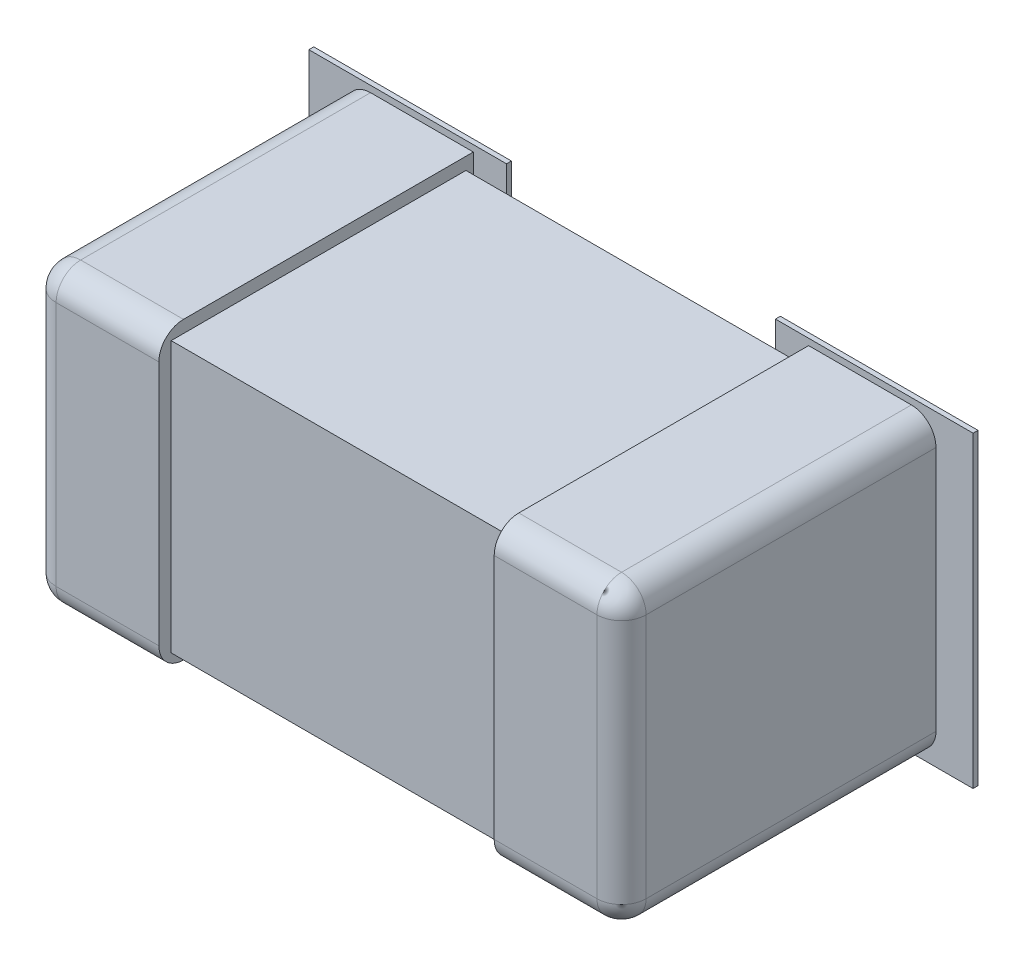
ISO-10303-21;
HEADER;
FILE_DESCRIPTION(('STEP AP214'),'2;1');
FILE_NAME('part.step','',(''),(''),'','','');
FILE_SCHEMA(('AUTOMOTIVE_DESIGN { 1 0 10303 214 1 1 1 1 }'));
ENDSEC;
DATA;
#1=APPLICATION_CONTEXT('core data for automotive mechanical design processes');
#2=APPLICATION_PROTOCOL_DEFINITION('international standard','automotive_design',2000,#1);
#3=PRODUCT_CONTEXT('',#1,'mechanical');
#4=PRODUCT('Part','Part','',(#3));
#5=PRODUCT_RELATED_PRODUCT_CATEGORY('part','',(#4));
#6=PRODUCT_DEFINITION_FORMATION('','',#4);
#7=PRODUCT_DEFINITION_CONTEXT('part definition',#1,'design');
#8=PRODUCT_DEFINITION('design','',#6,#7);
#9=PRODUCT_DEFINITION_SHAPE('','',#8);
#10=(LENGTH_UNIT() NAMED_UNIT(*) SI_UNIT(.MILLI.,.METRE.));
#11=(NAMED_UNIT(*) PLANE_ANGLE_UNIT() SI_UNIT($,.RADIAN.));
#12=(NAMED_UNIT(*) SI_UNIT($,.STERADIAN.) SOLID_ANGLE_UNIT());
#13=UNCERTAINTY_MEASURE_WITH_UNIT(LENGTH_MEASURE(1.E-05),#10,'distance_accuracy_value','');
#14=(GEOMETRIC_REPRESENTATION_CONTEXT(3) GLOBAL_UNCERTAINTY_ASSIGNED_CONTEXT((#13)) GLOBAL_UNIT_ASSIGNED_CONTEXT((#10,
#11,#12)) REPRESENTATION_CONTEXT('',''));
#15=CARTESIAN_POINT('',(0.,0.,0.));
#16=DIRECTION('',(0.,0.,1.));
#17=DIRECTION('',(1.,0.,0.));
#18=AXIS2_PLACEMENT_3D('',#15,#16,#17);
#19=CARTESIAN_POINT('',(0.,0.,0.0762));
#20=DIRECTION('',(0.,0.,1.));
#21=DIRECTION('',(1.,0.,0.));
#22=AXIS2_PLACEMENT_3D('',#19,#20,#21);
#23=PLANE('',#22);
#24=DIRECTION('',(1.,0.,0.));
#25=VECTOR('',#24,1.);
#26=CARTESIAN_POINT('',(0.138938,-0.159004,0.0762));
#27=LINE('',#26,#25);
#28=CARTESIAN_POINT('',(0.138938,-0.159004,0.0762));
#29=VERTEX_POINT('',#28);
#30=CARTESIAN_POINT('',(0.343154,-0.159004,0.0762));
#31=VERTEX_POINT('',#30);
#32=EDGE_CURVE('E330',#29,#31,#27,.T.);
#33=ORIENTED_EDGE('',*,*,#32,.F.);
#34=DIRECTION('',(0.,1.,0.));
#35=VECTOR('',#34,1.);
#36=CARTESIAN_POINT('',(0.138938,0.159004,0.0762));
#37=LINE('',#36,#35);
#38=CARTESIAN_POINT('',(0.138938,0.159004,0.0762));
#39=VERTEX_POINT('',#38);
#40=EDGE_CURVE('E335',#39,#29,#37,.F.);
#41=ORIENTED_EDGE('',*,*,#40,.F.);
#42=DIRECTION('',(1.,0.,0.));
#43=VECTOR('',#42,1.);
#44=CARTESIAN_POINT('',(0.343154,0.159004,0.0762));
#45=LINE('',#44,#43);
#46=CARTESIAN_POINT('',(0.343154,0.159004,0.0762));
#47=VERTEX_POINT('',#46);
#48=EDGE_CURVE('E319',#47,#39,#45,.F.);
#49=ORIENTED_EDGE('',*,*,#48,.F.);
#50=DIRECTION('',(0.,1.,0.));
#51=VECTOR('',#50,1.);
#52=CARTESIAN_POINT('',(0.343154,-0.159004,0.0762));
#53=LINE('',#52,#51);
#54=EDGE_CURVE('E95',#31,#47,#53,.T.);
#55=ORIENTED_EDGE('',*,*,#54,.F.);
#56=EDGE_LOOP('',(#33,#41,#49,#55));
#57=FACE_BOUND('',#56,.T.);
#58=ADVANCED_FACE('F16',(#57),#23,.F.);
#59=CARTESIAN_POINT('',(0.,0.,0.0762));
#60=DIRECTION('',(0.,0.,1.));
#61=DIRECTION('',(1.,0.,0.));
#62=AXIS2_PLACEMENT_3D('',#59,#60,#61);
#63=PLANE('',#62);
#64=DIRECTION('',(1.,0.,0.));
#65=VECTOR('',#64,1.);
#66=CARTESIAN_POINT('',(-0.138938,0.159004,0.0762));
#67=LINE('',#66,#65);
#68=CARTESIAN_POINT('',(-0.138938,0.159004,0.0762));
#69=VERTEX_POINT('',#68);
#70=CARTESIAN_POINT('',(-0.343154,0.159004,0.0762));
#71=VERTEX_POINT('',#70);
#72=EDGE_CURVE('E278',#69,#71,#67,.F.);
#73=ORIENTED_EDGE('',*,*,#72,.F.);
#74=DIRECTION('',(0.,1.,0.));
#75=VECTOR('',#74,1.);
#76=CARTESIAN_POINT('',(-0.138938,-0.159004,0.0762));
#77=LINE('',#76,#75);
#78=CARTESIAN_POINT('',(-0.138938,-0.159004,0.0762));
#79=VERTEX_POINT('',#78);
#80=EDGE_CURVE('E284',#79,#69,#77,.T.);
#81=ORIENTED_EDGE('',*,*,#80,.F.);
#82=DIRECTION('',(1.,0.,0.));
#83=VECTOR('',#82,1.);
#84=CARTESIAN_POINT('',(-0.343154,-0.159004,0.0762));
#85=LINE('',#84,#83);
#86=CARTESIAN_POINT('',(-0.343154,-0.159004,0.0762));
#87=VERTEX_POINT('',#86);
#88=EDGE_CURVE('E263',#87,#79,#85,.T.);
#89=ORIENTED_EDGE('',*,*,#88,.F.);
#90=DIRECTION('',(0.,1.,0.));
#91=VECTOR('',#90,1.);
#92=CARTESIAN_POINT('',(-0.343154,0.159004,0.0762));
#93=LINE('',#92,#91);
#94=EDGE_CURVE('E272',#71,#87,#93,.F.);
#95=ORIENTED_EDGE('',*,*,#94,.F.);
#96=EDGE_LOOP('',(#73,#81,#89,#95));
#97=FACE_BOUND('',#96,.T.);
#98=ADVANCED_FACE('F663',(#97),#63,.F.);
#99=CARTESIAN_POINT('',(0.138938,0.159004,0.0762));
#100=DIRECTION('',(-1.,0.,0.));
#101=DIRECTION('',(0.,0.,1.));
#102=AXIS2_PLACEMENT_3D('',#99,#100,#101);
#103=PLANE('',#102);
#104=DIRECTION('',(0.,0.,1.));
#105=VECTOR('',#104,1.);
#106=CARTESIAN_POINT('',(0.138938,0.159004,0.0762));
#107=LINE('',#106,#105);
#108=CARTESIAN_POINT('',(0.138938,0.159004,0.08128));
#109=VERTEX_POINT('',#108);
#110=EDGE_CURVE('E324',#39,#109,#107,.T.);
#111=ORIENTED_EDGE('',*,*,#110,.F.);
#112=ORIENTED_EDGE('',*,*,#40,.T.);
#113=DIRECTION('',(0.,0.,-1.));
#114=VECTOR('',#113,1.);
#115=CARTESIAN_POINT('',(0.138938,-0.159004,0.0762));
#116=LINE('',#115,#114);
#117=CARTESIAN_POINT('',(0.138938,-0.159004,0.08128));
#118=VERTEX_POINT('',#117);
#119=EDGE_CURVE('E332',#118,#29,#116,.T.);
#120=ORIENTED_EDGE('',*,*,#119,.F.);
#121=DIRECTION('',(0.,1.,0.));
#122=VECTOR('',#121,1.);
#123=CARTESIAN_POINT('',(0.138938,0.,0.08128));
#124=LINE('',#123,#122);
#125=EDGE_CURVE('E216',#109,#118,#124,.F.);
#126=ORIENTED_EDGE('',*,*,#125,.F.);
#127=EDGE_LOOP('',(#111,#112,#120,#126));
#128=FACE_BOUND('',#127,.T.);
#129=ADVANCED_FACE('F669',(#128),#103,.T.);
#130=CARTESIAN_POINT('',(0.138938,-0.159004,0.0762));
#131=DIRECTION('',(0.,-1.,0.));
#132=DIRECTION('',(0.,0.,-1.));
#133=AXIS2_PLACEMENT_3D('',#130,#131,#132);
#134=PLANE('',#133);
#135=ORIENTED_EDGE('',*,*,#119,.T.);
#136=ORIENTED_EDGE('',*,*,#32,.T.);
#137=DIRECTION('',(0.,0.,-1.));
#138=VECTOR('',#137,1.);
#139=CARTESIAN_POINT('',(0.343154,-0.159004,0.0762));
#140=LINE('',#139,#138);
#141=CARTESIAN_POINT('',(0.343154,-0.159004,0.08128));
#142=VERTEX_POINT('',#141);
#143=EDGE_CURVE('E328',#142,#31,#140,.T.);
#144=ORIENTED_EDGE('',*,*,#143,.F.);
#145=DIRECTION('',(1.,0.,0.));
#146=VECTOR('',#145,1.);
#147=CARTESIAN_POINT('',(0.,-0.159004,0.08128));
#148=LINE('',#147,#146);
#149=EDGE_CURVE('E213',#118,#142,#148,.T.);
#150=ORIENTED_EDGE('',*,*,#149,.F.);
#151=EDGE_LOOP('',(#135,#136,#144,#150));
#152=FACE_BOUND('',#151,.T.);
#153=ADVANCED_FACE('F714',(#152),#134,.T.);
#154=CARTESIAN_POINT('',(0.343154,-0.159004,0.0762));
#155=DIRECTION('',(1.,0.,0.));
#156=DIRECTION('',(0.,0.,-1.));
#157=AXIS2_PLACEMENT_3D('',#154,#155,#156);
#158=PLANE('',#157);
#159=ORIENTED_EDGE('',*,*,#143,.T.);
#160=ORIENTED_EDGE('',*,*,#54,.T.);
#161=DIRECTION('',(0.,0.,1.));
#162=VECTOR('',#161,1.);
#163=CARTESIAN_POINT('',(0.343154,0.159004,0.0762));
#164=LINE('',#163,#162);
#165=CARTESIAN_POINT('',(0.343154,0.159004,0.08128));
#166=VERTEX_POINT('',#165);
#167=EDGE_CURVE('E322',#166,#47,#164,.F.);
#168=ORIENTED_EDGE('',*,*,#167,.F.);
#169=DIRECTION('',(0.,1.,0.));
#170=VECTOR('',#169,1.);
#171=CARTESIAN_POINT('',(0.343154,0.,0.08128));
#172=LINE('',#171,#170);
#173=EDGE_CURVE('E210',#142,#166,#172,.T.);
#174=ORIENTED_EDGE('',*,*,#173,.F.);
#175=EDGE_LOOP('',(#159,#160,#168,#174));
#176=FACE_BOUND('',#175,.T.);
#177=ADVANCED_FACE('F721',(#176),#158,.T.);
#178=CARTESIAN_POINT('',(0.343154,0.159004,0.0762));
#179=DIRECTION('',(0.,1.,0.));
#180=DIRECTION('',(0.,0.,1.));
#181=AXIS2_PLACEMENT_3D('',#178,#179,#180);
#182=PLANE('',#181);
#183=ORIENTED_EDGE('',*,*,#167,.T.);
#184=ORIENTED_EDGE('',*,*,#48,.T.);
#185=ORIENTED_EDGE('',*,*,#110,.T.);
#186=DIRECTION('',(1.,0.,0.));
#187=VECTOR('',#186,1.);
#188=CARTESIAN_POINT('',(0.,0.159004,0.08128));
#189=LINE('',#188,#187);
#190=EDGE_CURVE('E207',#166,#109,#189,.F.);
#191=ORIENTED_EDGE('',*,*,#190,.F.);
#192=EDGE_LOOP('',(#183,#184,#185,#191));
#193=FACE_BOUND('',#192,.T.);
#194=ADVANCED_FACE('F729',(#193),#182,.T.);
#195=CARTESIAN_POINT('',(0.3048,-0.1524,0.0762));
#196=DIRECTION('',(1.,0.,0.));
#197=DIRECTION('',(0.,0.,-1.));
#198=AXIS2_PLACEMENT_3D('',#195,#196,#197);
#199=PLANE('',#198);
#200=DIRECTION('',(0.,0.,-1.));
#201=VECTOR('',#200,1.);
#202=CARTESIAN_POINT('',(0.3048,-0.127,0.8362636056));
#203=LINE('',#202,#201);
#204=CARTESIAN_POINT('',(0.3048,-0.127,0.08128));
#205=VERTEX_POINT('',#204);
#206=CARTESIAN_POINT('',(0.3048,-0.127,0.380746));
#207=VERTEX_POINT('',#206);
#208=EDGE_CURVE('E315',#205,#207,#203,.F.);
#209=ORIENTED_EDGE('',*,*,#208,.F.);
#210=DIRECTION('',(0.,1.,0.));
#211=VECTOR('',#210,1.);
#212=CARTESIAN_POINT('',(0.3048,0.,0.08128));
#213=LINE('',#212,#211);
#214=CARTESIAN_POINT('',(0.3048,0.127,0.08128));
#215=VERTEX_POINT('',#214);
#216=EDGE_CURVE('E205',#215,#205,#213,.F.);
#217=ORIENTED_EDGE('',*,*,#216,.F.);
#218=DIRECTION('',(0.,0.,-1.));
#219=VECTOR('',#218,1.);
#220=CARTESIAN_POINT('',(0.3048,0.127,0.8362636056));
#221=LINE('',#220,#219);
#222=CARTESIAN_POINT('',(0.3048,0.127,0.380746));
#223=VERTEX_POINT('',#222);
#224=EDGE_CURVE('E86',#223,#215,#221,.T.);
#225=ORIENTED_EDGE('',*,*,#224,.F.);
#226=DIRECTION('',(0.,1.,0.));
#227=VECTOR('',#226,1.);
#228=CARTESIAN_POINT('',(0.3048,-0.5735592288,0.380746));
#229=LINE('',#228,#227);
#230=EDGE_CURVE('E341',#207,#223,#229,.T.);
#231=ORIENTED_EDGE('',*,*,#230,.F.);
#232=EDGE_LOOP('',(#209,#217,#225,#231));
#233=FACE_BOUND('',#232,.T.);
#234=ADVANCED_FACE('F736',(#233),#199,.T.);
#235=CARTESIAN_POINT('',(0.2794,0.127,0.8362636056));
#236=DIRECTION('',(0.,0.,-1.));
#237=DIRECTION('',(-1.,0.,0.));
#238=AXIS2_PLACEMENT_3D('',#235,#236,#237);
#239=CYLINDRICAL_SURFACE('',#238,0.0254);
#240=ORIENTED_EDGE('',*,*,#224,.T.);
#241=CARTESIAN_POINT('',(0.2794,0.127,0.08128));
#242=DIRECTION('',(0.,0.,-1.));
#243=DIRECTION('',(-1.,0.,0.));
#244=AXIS2_PLACEMENT_3D('',#241,#242,#243);
#245=CIRCLE('',#244,0.0254);
#246=CARTESIAN_POINT('',(0.2794,0.1524,0.08128));
#247=VERTEX_POINT('',#246);
#248=EDGE_CURVE('E185',#247,#215,#245,.T.);
#249=ORIENTED_EDGE('',*,*,#248,.F.);
#250=DIRECTION('',(0.,0.,1.));
#251=VECTOR('',#250,1.);
#252=CARTESIAN_POINT('',(0.2794,0.1524,0.0762));
#253=LINE('',#252,#251);
#254=CARTESIAN_POINT('',(0.2794,0.1524,0.380746));
#255=VERTEX_POINT('',#254);
#256=EDGE_CURVE('E162',#255,#247,#253,.F.);
#257=ORIENTED_EDGE('',*,*,#256,.F.);
#258=CARTESIAN_POINT('',(0.2794,0.127,0.380746));
#259=DIRECTION('',(0.,0.,-1.));
#260=DIRECTION('',(-1.,0.,0.));
#261=AXIS2_PLACEMENT_3D('',#258,#259,#260);
#262=CIRCLE('',#261,0.0254);
#263=EDGE_CURVE('E19',#223,#255,#262,.F.);
#264=ORIENTED_EDGE('',*,*,#263,.F.);
#265=EDGE_LOOP('',(#240,#249,#257,#264));
#266=FACE_BOUND('',#265,.T.);
#267=ADVANCED_FACE('F183',(#266),#239,.T.);
#268=CARTESIAN_POINT('',(0.2794,0.127,0.380746));
#269=DIRECTION('',(0.,0.707106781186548,0.707106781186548));
#270=DIRECTION('',(1.,0.,0.));
#271=AXIS2_PLACEMENT_3D('',#268,#269,#270);
#272=SPHERICAL_SURFACE('',#271,0.0254);
#273=CARTESIAN_POINT('',(0.2794,0.127,0.380746));
#274=DIRECTION('',(-1.,0.,0.));
#275=DIRECTION('',(0.,0.,1.));
#276=AXIS2_PLACEMENT_3D('',#273,#274,#275);
#277=CIRCLE('',#276,0.0254);
#278=CARTESIAN_POINT('',(0.2794,0.127,0.406146));
#279=VERTEX_POINT('',#278);
#280=CARTESIAN_POINT('',(0.2794,0.144960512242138,0.398706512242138));
#281=VERTEX_POINT('',#280);
#282=EDGE_CURVE('E181',#279,#281,#277,.T.);
#283=ORIENTED_EDGE('',*,*,#282,.F.);
#284=CARTESIAN_POINT('',(0.2794,0.127,0.380746));
#285=DIRECTION('',(0.,1.,0.));
#286=DIRECTION('',(0.,0.,1.));
#287=AXIS2_PLACEMENT_3D('',#284,#285,#286);
#288=CIRCLE('',#287,0.0254);
#289=EDGE_CURVE('E172',#223,#279,#288,.F.);
#290=ORIENTED_EDGE('',*,*,#289,.F.);
#291=ORIENTED_EDGE('',*,*,#263,.T.);
#292=CARTESIAN_POINT('',(0.2794,0.127,0.380746));
#293=DIRECTION('',(-1.,0.,0.));
#294=DIRECTION('',(0.,0.,1.));
#295=AXIS2_PLACEMENT_3D('',#292,#293,#294);
#296=CIRCLE('',#295,0.0254);
#297=EDGE_CURVE('E171',#281,#255,#296,.T.);
#298=ORIENTED_EDGE('',*,*,#297,.F.);
#299=EDGE_LOOP('',(#283,#290,#291,#298));
#300=FACE_BOUND('',#299,.T.);
#301=ADVANCED_FACE('F170',(#300),#272,.T.);
#302=CARTESIAN_POINT('',(0.2794,-0.5735592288,0.380746));
#303=DIRECTION('',(0.,1.,0.));
#304=DIRECTION('',(0.,0.,1.));
#305=AXIS2_PLACEMENT_3D('',#302,#303,#304);
#306=CYLINDRICAL_SURFACE('',#305,0.0254);
#307=CARTESIAN_POINT('',(0.2794,-0.127,0.380746));
#308=DIRECTION('',(0.,1.,0.));
#309=DIRECTION('',(0.,0.,1.));
#310=AXIS2_PLACEMENT_3D('',#307,#308,#309);
#311=CIRCLE('',#310,0.0254);
#312=CARTESIAN_POINT('',(0.297360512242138,-0.127,0.398706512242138));
#313=VERTEX_POINT('',#312);
#314=EDGE_CURVE('E343',#207,#313,#311,.F.);
#315=ORIENTED_EDGE('',*,*,#314,.F.);
#316=ORIENTED_EDGE('',*,*,#230,.T.);
#317=ORIENTED_EDGE('',*,*,#289,.T.);
#318=DIRECTION('',(0.,1.,0.));
#319=VECTOR('',#318,1.);
#320=CARTESIAN_POINT('',(0.2794,0.,0.406146));
#321=LINE('',#320,#319);
#322=CARTESIAN_POINT('',(0.2794,-0.127,0.406146));
#323=VERTEX_POINT('',#322);
#324=EDGE_CURVE('E194',#323,#279,#321,.T.);
#325=ORIENTED_EDGE('',*,*,#324,.F.);
#326=CARTESIAN_POINT('',(0.2794,-0.127,0.380746));
#327=DIRECTION('',(0.,-1.,0.));
#328=DIRECTION('',(0.707106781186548,0.,0.707106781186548));
#329=AXIS2_PLACEMENT_3D('',#326,#327,#328);
#330=CIRCLE('',#329,0.0254);
#331=EDGE_CURVE('E295',#313,#323,#330,.T.);
#332=ORIENTED_EDGE('',*,*,#331,.F.);
#333=EDGE_LOOP('',(#315,#316,#317,#325,#332));
#334=FACE_BOUND('',#333,.T.);
#335=ADVANCED_FACE('F303',(#334),#306,.T.);
#336=CARTESIAN_POINT('',(0.2794,-0.127,0.380746));
#337=DIRECTION('',(0.707106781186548,0.,0.707106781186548));
#338=DIRECTION('',(0.,-1.,0.));
#339=AXIS2_PLACEMENT_3D('',#336,#337,#338);
#340=SPHERICAL_SURFACE('',#339,0.0254);
#341=ORIENTED_EDGE('',*,*,#331,.T.);
#342=CARTESIAN_POINT('',(0.2794,-0.127,0.380746));
#343=DIRECTION('',(1.,0.,0.));
#344=DIRECTION('',(0.,0.,-1.));
#345=AXIS2_PLACEMENT_3D('',#342,#343,#344);
#346=CIRCLE('',#345,0.0254);
#347=CARTESIAN_POINT('',(0.2794,-0.1524,0.380746));
#348=VERTEX_POINT('',#347);
#349=EDGE_CURVE('E373',#348,#323,#346,.F.);
#350=ORIENTED_EDGE('',*,*,#349,.F.);
#351=CARTESIAN_POINT('',(0.2794,-0.127,0.380746));
#352=DIRECTION('',(0.,0.,-1.));
#353=DIRECTION('',(-1.,0.,0.));
#354=AXIS2_PLACEMENT_3D('',#351,#352,#353);
#355=CIRCLE('',#354,0.0254);
#356=EDGE_CURVE('E287',#207,#348,#355,.T.);
#357=ORIENTED_EDGE('',*,*,#356,.F.);
#358=ORIENTED_EDGE('',*,*,#314,.T.);
#359=EDGE_LOOP('',(#341,#350,#357,#358));
#360=FACE_BOUND('',#359,.T.);
#361=ADVANCED_FACE('F298',(#360),#340,.T.);
#362=CARTESIAN_POINT('',(0.2794,-0.127,0.8362636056));
#363=DIRECTION('',(0.,0.,-1.));
#364=DIRECTION('',(-1.,0.,0.));
#365=AXIS2_PLACEMENT_3D('',#362,#363,#364);
#366=CYLINDRICAL_SURFACE('',#365,0.0254);
#367=DIRECTION('',(0.,0.,-1.));
#368=VECTOR('',#367,1.);
#369=CARTESIAN_POINT('',(0.2794,-0.1524,0.0762));
#370=LINE('',#369,#368);
#371=CARTESIAN_POINT('',(0.2794,-0.1524,0.08128));
#372=VERTEX_POINT('',#371);
#373=EDGE_CURVE('E288',#372,#348,#370,.F.);
#374=ORIENTED_EDGE('',*,*,#373,.F.);
#375=CARTESIAN_POINT('',(0.2794,-0.127,0.08128));
#376=DIRECTION('',(0.,0.,-1.));
#377=DIRECTION('',(-1.,0.,0.));
#378=AXIS2_PLACEMENT_3D('',#375,#376,#377);
#379=CIRCLE('',#378,0.0254);
#380=EDGE_CURVE('E188',#205,#372,#379,.T.);
#381=ORIENTED_EDGE('',*,*,#380,.F.);
#382=ORIENTED_EDGE('',*,*,#208,.T.);
#383=ORIENTED_EDGE('',*,*,#356,.T.);
#384=EDGE_LOOP('',(#374,#381,#382,#383));
#385=FACE_BOUND('',#384,.T.);
#386=ADVANCED_FACE('F302',(#385),#366,.T.);
#387=CARTESIAN_POINT('',(-0.138938,-0.159004,0.0762));
#388=DIRECTION('',(1.,0.,0.));
#389=DIRECTION('',(0.,0.,-1.));
#390=AXIS2_PLACEMENT_3D('',#387,#388,#389);
#391=PLANE('',#390);
#392=DIRECTION('',(0.,0.,-1.));
#393=VECTOR('',#392,1.);
#394=CARTESIAN_POINT('',(-0.138938,-0.159004,0.0762));
#395=LINE('',#394,#393);
#396=CARTESIAN_POINT('',(-0.138938,-0.159004,0.08128));
#397=VERTEX_POINT('',#396);
#398=EDGE_CURVE('E269',#79,#397,#395,.F.);
#399=ORIENTED_EDGE('',*,*,#398,.F.);
#400=ORIENTED_EDGE('',*,*,#80,.T.);
#401=DIRECTION('',(0.,0.,1.));
#402=VECTOR('',#401,1.);
#403=CARTESIAN_POINT('',(-0.138938,0.159004,0.0762));
#404=LINE('',#403,#402);
#405=CARTESIAN_POINT('',(-0.138938,0.159004,0.08128));
#406=VERTEX_POINT('',#405);
#407=EDGE_CURVE('E281',#406,#69,#404,.F.);
#408=ORIENTED_EDGE('',*,*,#407,.F.);
#409=DIRECTION('',(0.,1.,0.));
#410=VECTOR('',#409,1.);
#411=CARTESIAN_POINT('',(-0.138938,0.,0.08128));
#412=LINE('',#411,#410);
#413=EDGE_CURVE('E438',#397,#406,#412,.T.);
#414=ORIENTED_EDGE('',*,*,#413,.F.);
#415=EDGE_LOOP('',(#399,#400,#408,#414));
#416=FACE_BOUND('',#415,.T.);
#417=ADVANCED_FACE('F766',(#416),#391,.T.);
#418=CARTESIAN_POINT('',(-0.138938,0.159004,0.0762));
#419=DIRECTION('',(0.,1.,0.));
#420=DIRECTION('',(0.,0.,1.));
#421=AXIS2_PLACEMENT_3D('',#418,#419,#420);
#422=PLANE('',#421);
#423=ORIENTED_EDGE('',*,*,#407,.T.);
#424=ORIENTED_EDGE('',*,*,#72,.T.);
#425=DIRECTION('',(0.,0.,1.));
#426=VECTOR('',#425,1.);
#427=CARTESIAN_POINT('',(-0.343154,0.159004,0.0762));
#428=LINE('',#427,#426);
#429=CARTESIAN_POINT('',(-0.343154,0.159004,0.08128));
#430=VERTEX_POINT('',#429);
#431=EDGE_CURVE('E275',#430,#71,#428,.F.);
#432=ORIENTED_EDGE('',*,*,#431,.F.);
#433=DIRECTION('',(1.,0.,0.));
#434=VECTOR('',#433,1.);
#435=CARTESIAN_POINT('',(0.,0.159004,0.08128));
#436=LINE('',#435,#434);
#437=EDGE_CURVE('E435',#406,#430,#436,.F.);
#438=ORIENTED_EDGE('',*,*,#437,.F.);
#439=EDGE_LOOP('',(#423,#424,#432,#438));
#440=FACE_BOUND('',#439,.T.);
#441=ADVANCED_FACE('F772',(#440),#422,.T.);
#442=CARTESIAN_POINT('',(-0.343154,0.159004,0.0762));
#443=DIRECTION('',(-1.,0.,0.));
#444=DIRECTION('',(0.,0.,1.));
#445=AXIS2_PLACEMENT_3D('',#442,#443,#444);
#446=PLANE('',#445);
#447=ORIENTED_EDGE('',*,*,#431,.T.);
#448=ORIENTED_EDGE('',*,*,#94,.T.);
#449=DIRECTION('',(0.,0.,-1.));
#450=VECTOR('',#449,1.);
#451=CARTESIAN_POINT('',(-0.343154,-0.159004,0.0762));
#452=LINE('',#451,#450);
#453=CARTESIAN_POINT('',(-0.343154,-0.159004,0.08128));
#454=VERTEX_POINT('',#453);
#455=EDGE_CURVE('E266',#454,#87,#452,.T.);
#456=ORIENTED_EDGE('',*,*,#455,.F.);
#457=DIRECTION('',(0.,1.,0.));
#458=VECTOR('',#457,1.);
#459=CARTESIAN_POINT('',(-0.343154,0.,0.08128));
#460=LINE('',#459,#458);
#461=EDGE_CURVE('E432',#430,#454,#460,.F.);
#462=ORIENTED_EDGE('',*,*,#461,.F.);
#463=EDGE_LOOP('',(#447,#448,#456,#462));
#464=FACE_BOUND('',#463,.T.);
#465=ADVANCED_FACE('F779',(#464),#446,.T.);
#466=CARTESIAN_POINT('',(-0.343154,-0.159004,0.0762));
#467=DIRECTION('',(0.,-1.,0.));
#468=DIRECTION('',(0.,0.,-1.));
#469=AXIS2_PLACEMENT_3D('',#466,#467,#468);
#470=PLANE('',#469);
#471=ORIENTED_EDGE('',*,*,#455,.T.);
#472=ORIENTED_EDGE('',*,*,#88,.T.);
#473=ORIENTED_EDGE('',*,*,#398,.T.);
#474=DIRECTION('',(1.,0.,0.));
#475=VECTOR('',#474,1.);
#476=CARTESIAN_POINT('',(0.,-0.159004,0.08128));
#477=LINE('',#476,#475);
#478=EDGE_CURVE('E372',#454,#397,#477,.T.);
#479=ORIENTED_EDGE('',*,*,#478,.F.);
#480=EDGE_LOOP('',(#471,#472,#473,#479));
#481=FACE_BOUND('',#480,.T.);
#482=ADVANCED_FACE('F787',(#481),#470,.T.);
#483=CARTESIAN_POINT('',(-0.3048,0.1524,0.0762));
#484=DIRECTION('',(-1.,0.,0.));
#485=DIRECTION('',(0.,0.,1.));
#486=AXIS2_PLACEMENT_3D('',#483,#484,#485);
#487=PLANE('',#486);
#488=DIRECTION('',(0.,0.,-1.));
#489=VECTOR('',#488,1.);
#490=CARTESIAN_POINT('',(-0.3048,0.127,0.8362636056));
#491=LINE('',#490,#489);
#492=CARTESIAN_POINT('',(-0.3048,0.127,0.08128));
#493=VERTEX_POINT('',#492);
#494=CARTESIAN_POINT('',(-0.3048,0.127,0.380746));
#495=VERTEX_POINT('',#494);
#496=EDGE_CURVE('E226',#493,#495,#491,.F.);
#497=ORIENTED_EDGE('',*,*,#496,.F.);
#498=DIRECTION('',(0.,1.,0.));
#499=VECTOR('',#498,1.);
#500=CARTESIAN_POINT('',(-0.3048,0.,0.08128));
#501=LINE('',#500,#499);
#502=CARTESIAN_POINT('',(-0.3048,-0.127,0.08128));
#503=VERTEX_POINT('',#502);
#504=EDGE_CURVE('E368',#503,#493,#501,.T.);
#505=ORIENTED_EDGE('',*,*,#504,.F.);
#506=DIRECTION('',(0.,0.,-1.));
#507=VECTOR('',#506,1.);
#508=CARTESIAN_POINT('',(-0.3048,-0.127,0.8362636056));
#509=LINE('',#508,#507);
#510=CARTESIAN_POINT('',(-0.3048,-0.127,0.380746));
#511=VERTEX_POINT('',#510);
#512=EDGE_CURVE('E260',#511,#503,#509,.T.);
#513=ORIENTED_EDGE('',*,*,#512,.F.);
#514=DIRECTION('',(0.,-1.,0.));
#515=VECTOR('',#514,1.);
#516=CARTESIAN_POINT('',(-0.3048,0.5735592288,0.380746));
#517=LINE('',#516,#515);
#518=EDGE_CURVE('E337',#495,#511,#517,.T.);
#519=ORIENTED_EDGE('',*,*,#518,.F.);
#520=EDGE_LOOP('',(#497,#505,#513,#519));
#521=FACE_BOUND('',#520,.T.);
#522=ADVANCED_FACE('F795',(#521),#487,.T.);
#523=CARTESIAN_POINT('',(-0.2794,-0.127,0.8362636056));
#524=DIRECTION('',(0.,0.,-1.));
#525=DIRECTION('',(-1.,0.,0.));
#526=AXIS2_PLACEMENT_3D('',#523,#524,#525);
#527=CYLINDRICAL_SURFACE('',#526,0.0254);
#528=ORIENTED_EDGE('',*,*,#512,.T.);
#529=CARTESIAN_POINT('',(-0.2794,-0.127,0.08128));
#530=DIRECTION('',(0.,0.,-1.));
#531=DIRECTION('',(-1.,0.,0.));
#532=AXIS2_PLACEMENT_3D('',#529,#530,#531);
#533=CIRCLE('',#532,0.0254);
#534=CARTESIAN_POINT('',(-0.2794,-0.1524,0.08128));
#535=VERTEX_POINT('',#534);
#536=EDGE_CURVE('E369',#535,#503,#533,.T.);
#537=ORIENTED_EDGE('',*,*,#536,.F.);
#538=DIRECTION('',(0.,0.,-1.));
#539=VECTOR('',#538,1.);
#540=CARTESIAN_POINT('',(-0.2794,-0.1524,0.0762));
#541=LINE('',#540,#539);
#542=CARTESIAN_POINT('',(-0.2794,-0.1524,0.380746));
#543=VERTEX_POINT('',#542);
#544=EDGE_CURVE('E257',#543,#535,#541,.T.);
#545=ORIENTED_EDGE('',*,*,#544,.F.);
#546=CARTESIAN_POINT('',(-0.2794,-0.127,0.380746));
#547=DIRECTION('',(0.,0.,-1.));
#548=DIRECTION('',(-1.,0.,0.));
#549=AXIS2_PLACEMENT_3D('',#546,#547,#548);
#550=CIRCLE('',#549,0.0254);
#551=EDGE_CURVE('E262',#511,#543,#550,.F.);
#552=ORIENTED_EDGE('',*,*,#551,.F.);
#553=EDGE_LOOP('',(#528,#537,#545,#552));
#554=FACE_BOUND('',#553,.T.);
#555=ADVANCED_FACE('F252',(#554),#527,.T.);
#556=CARTESIAN_POINT('',(-0.2794,-0.127,0.380746));
#557=DIRECTION('',(0.,-0.707106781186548,0.707106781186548));
#558=DIRECTION('',(-1.,0.,0.));
#559=AXIS2_PLACEMENT_3D('',#556,#557,#558);
#560=SPHERICAL_SURFACE('',#559,0.0254);
#561=CARTESIAN_POINT('',(-0.2794,-0.127,0.380746));
#562=DIRECTION('',(1.,0.,0.));
#563=DIRECTION('',(0.,0.,-1.));
#564=AXIS2_PLACEMENT_3D('',#561,#562,#563);
#565=CIRCLE('',#564,0.0254);
#566=CARTESIAN_POINT('',(-0.2794,-0.127,0.406146));
#567=VERTEX_POINT('',#566);
#568=CARTESIAN_POINT('',(-0.2794,-0.144960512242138,0.398706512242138));
#569=VERTEX_POINT('',#568);
#570=EDGE_CURVE('E234',#567,#569,#565,.T.);
#571=ORIENTED_EDGE('',*,*,#570,.F.);
#572=CARTESIAN_POINT('',(-0.2794,-0.127,0.380746));
#573=DIRECTION('',(0.,-1.,0.));
#574=DIRECTION('',(0.,0.,-1.));
#575=AXIS2_PLACEMENT_3D('',#572,#573,#574);
#576=CIRCLE('',#575,0.0254);
#577=EDGE_CURVE('E340',#511,#567,#576,.F.);
#578=ORIENTED_EDGE('',*,*,#577,.F.);
#579=ORIENTED_EDGE('',*,*,#551,.T.);
#580=CARTESIAN_POINT('',(-0.2794,-0.127,0.380746));
#581=DIRECTION('',(1.,0.,0.));
#582=DIRECTION('',(0.,0.,-1.));
#583=AXIS2_PLACEMENT_3D('',#580,#581,#582);
#584=CIRCLE('',#583,0.0254);
#585=EDGE_CURVE('E363',#569,#543,#584,.T.);
#586=ORIENTED_EDGE('',*,*,#585,.F.);
#587=EDGE_LOOP('',(#571,#578,#579,#586));
#588=FACE_BOUND('',#587,.T.);
#589=ADVANCED_FACE('F247',(#588),#560,.T.);
#590=CARTESIAN_POINT('',(-0.2794,0.5735592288,0.380746));
#591=DIRECTION('',(0.,-1.,0.));
#592=DIRECTION('',(0.,0.,-1.));
#593=AXIS2_PLACEMENT_3D('',#590,#591,#592);
#594=CYLINDRICAL_SURFACE('',#593,0.0254);
#595=CARTESIAN_POINT('',(-0.2794,0.127,0.380746));
#596=DIRECTION('',(0.,-1.,0.));
#597=DIRECTION('',(0.,0.,-1.));
#598=AXIS2_PLACEMENT_3D('',#595,#596,#597);
#599=CIRCLE('',#598,0.0254);
#600=CARTESIAN_POINT('',(-0.2794,0.127,0.406146));
#601=VERTEX_POINT('',#600);
#602=EDGE_CURVE('E259',#495,#601,#599,.F.);
#603=ORIENTED_EDGE('',*,*,#602,.F.);
#604=ORIENTED_EDGE('',*,*,#518,.T.);
#605=ORIENTED_EDGE('',*,*,#577,.T.);
#606=DIRECTION('',(0.,1.,0.));
#607=VECTOR('',#606,1.);
#608=CARTESIAN_POINT('',(-0.2794,0.,0.406146));
#609=LINE('',#608,#607);
#610=EDGE_CURVE('E227',#601,#567,#609,.F.);
#611=ORIENTED_EDGE('',*,*,#610,.F.);
#612=EDGE_LOOP('',(#603,#604,#605,#611));
#613=FACE_BOUND('',#612,.T.);
#614=ADVANCED_FACE('F242',(#613),#594,.T.);
#615=CARTESIAN_POINT('',(-0.2794,0.127,0.380746));
#616=DIRECTION('',(-0.707106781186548,0.707106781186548,0.));
#617=DIRECTION('',(0.,0.,1.));
#618=AXIS2_PLACEMENT_3D('',#615,#616,#617);
#619=SPHERICAL_SURFACE('',#618,0.0254);
#620=ORIENTED_EDGE('',*,*,#602,.T.);
#621=CARTESIAN_POINT('',(-0.2794,0.127,0.380746));
#622=DIRECTION('',(-1.,0.,0.));
#623=DIRECTION('',(0.,0.,1.));
#624=AXIS2_PLACEMENT_3D('',#621,#622,#623);
#625=CIRCLE('',#624,0.0254);
#626=CARTESIAN_POINT('',(-0.2794,0.1524,0.380746));
#627=VERTEX_POINT('',#626);
#628=EDGE_CURVE('E360',#627,#601,#625,.F.);
#629=ORIENTED_EDGE('',*,*,#628,.F.);
#630=CARTESIAN_POINT('',(-0.2794,0.127,0.380746));
#631=DIRECTION('',(0.,0.,-1.));
#632=DIRECTION('',(-1.,0.,0.));
#633=AXIS2_PLACEMENT_3D('',#630,#631,#632);
#634=CIRCLE('',#633,0.0254);
#635=CARTESIAN_POINT('',(-0.297360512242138,0.144960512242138,0.380746));
#636=VERTEX_POINT('',#635);
#637=EDGE_CURVE('E219',#636,#627,#634,.T.);
#638=ORIENTED_EDGE('',*,*,#637,.F.);
#639=CARTESIAN_POINT('',(-0.2794,0.127,0.380746));
#640=DIRECTION('',(0.,0.,-1.));
#641=DIRECTION('',(-1.,0.,0.));
#642=AXIS2_PLACEMENT_3D('',#639,#640,#641);
#643=CIRCLE('',#642,0.0254);
#644=EDGE_CURVE('E34',#495,#636,#643,.T.);
#645=ORIENTED_EDGE('',*,*,#644,.F.);
#646=EDGE_LOOP('',(#620,#629,#638,#645));
#647=FACE_BOUND('',#646,.T.);
#648=ADVANCED_FACE('F237',(#647),#619,.T.);
#649=CARTESIAN_POINT('',(-0.2794,0.127,0.8362636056));
#650=DIRECTION('',(0.,0.,-1.));
#651=DIRECTION('',(-1.,0.,0.));
#652=AXIS2_PLACEMENT_3D('',#649,#650,#651);
#653=CYLINDRICAL_SURFACE('',#652,0.0254);
#654=DIRECTION('',(0.,0.,1.));
#655=VECTOR('',#654,1.);
#656=CARTESIAN_POINT('',(-0.2794,0.1524,0.0762));
#657=LINE('',#656,#655);
#658=CARTESIAN_POINT('',(-0.2794,0.1524,0.08128));
#659=VERTEX_POINT('',#658);
#660=EDGE_CURVE('E220',#659,#627,#657,.T.);
#661=ORIENTED_EDGE('',*,*,#660,.F.);
#662=CARTESIAN_POINT('',(-0.2794,0.127,0.08128));
#663=DIRECTION('',(0.,0.,-1.));
#664=DIRECTION('',(-1.,0.,0.));
#665=AXIS2_PLACEMENT_3D('',#662,#663,#664);
#666=CIRCLE('',#665,0.0254);
#667=EDGE_CURVE('E366',#493,#659,#666,.T.);
#668=ORIENTED_EDGE('',*,*,#667,.F.);
#669=ORIENTED_EDGE('',*,*,#496,.T.);
#670=ORIENTED_EDGE('',*,*,#644,.T.);
#671=ORIENTED_EDGE('',*,*,#637,.T.);
#672=EDGE_LOOP('',(#661,#668,#669,#670,#671));
#673=FACE_BOUND('',#672,.T.);
#674=ADVANCED_FACE('F241',(#673),#653,.T.);
#675=CARTESIAN_POINT('',(0.,0.,0.08128));
#676=DIRECTION('',(0.,0.,1.));
#677=DIRECTION('',(1.,0.,0.));
#678=AXIS2_PLACEMENT_3D('',#675,#676,#677);
#679=PLANE('',#678);
#680=DIRECTION('',(0.,1.,0.));
#681=VECTOR('',#680,1.);
#682=CARTESIAN_POINT('',(0.173228,-0.1524,0.08128));
#683=LINE('',#682,#681);
#684=CARTESIAN_POINT('',(0.173228,-0.1524,0.08128));
#685=VERTEX_POINT('',#684);
#686=CARTESIAN_POINT('',(0.173228,0.1524,0.08128));
#687=VERTEX_POINT('',#686);
#688=EDGE_CURVE('E403',#685,#687,#683,.T.);
#689=ORIENTED_EDGE('',*,*,#688,.T.);
#690=DIRECTION('',(1.,0.,0.));
#691=VECTOR('',#690,1.);
#692=CARTESIAN_POINT('',(0.3048,0.1524,0.08128));
#693=LINE('',#692,#691);
#694=EDGE_CURVE('E187',#247,#687,#693,.F.);
#695=ORIENTED_EDGE('',*,*,#694,.F.);
#696=ORIENTED_EDGE('',*,*,#248,.T.);
#697=ORIENTED_EDGE('',*,*,#216,.T.);
#698=ORIENTED_EDGE('',*,*,#380,.T.);
#699=DIRECTION('',(1.,0.,0.));
#700=VECTOR('',#699,1.);
#701=CARTESIAN_POINT('',(-0.3048,-0.1524,0.08128));
#702=LINE('',#701,#700);
#703=EDGE_CURVE('E441',#685,#372,#702,.T.);
#704=ORIENTED_EDGE('',*,*,#703,.F.);
#705=EDGE_LOOP('',(#689,#695,#696,#697,#698,#704));
#706=FACE_BOUND('',#705,.T.);
#707=ORIENTED_EDGE('',*,*,#173,.T.);
#708=ORIENTED_EDGE('',*,*,#190,.T.);
#709=ORIENTED_EDGE('',*,*,#125,.T.);
#710=ORIENTED_EDGE('',*,*,#149,.T.);
#711=EDGE_LOOP('',(#707,#708,#709,#710));
#712=FACE_BOUND('',#711,.T.);
#713=ADVANCED_FACE('F463',(#706,#712),#679,.T.);
#714=CARTESIAN_POINT('',(0.3048,0.1524,0.0762));
#715=DIRECTION('',(0.,1.,0.));
#716=DIRECTION('',(0.,0.,1.));
#717=AXIS2_PLACEMENT_3D('',#714,#715,#716);
#718=PLANE('',#717);
#719=ORIENTED_EDGE('',*,*,#256,.T.);
#720=ORIENTED_EDGE('',*,*,#694,.T.);
#721=DIRECTION('',(0.,0.,-1.));
#722=VECTOR('',#721,1.);
#723=CARTESIAN_POINT('',(0.173228,0.1524,0.0889));
#724=LINE('',#723,#722);
#725=CARTESIAN_POINT('',(0.173228,0.1524,0.380746));
#726=VERTEX_POINT('',#725);
#727=EDGE_CURVE('E193',#687,#726,#724,.F.);
#728=ORIENTED_EDGE('',*,*,#727,.T.);
#729=DIRECTION('',(-1.,0.,0.));
#730=VECTOR('',#729,1.);
#731=CARTESIAN_POINT('',(1.2378251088,0.1524,0.380746));
#732=LINE('',#731,#730);
#733=EDGE_CURVE('E178',#255,#726,#732,.T.);
#734=ORIENTED_EDGE('',*,*,#733,.F.);
#735=EDGE_LOOP('',(#719,#720,#728,#734));
#736=FACE_BOUND('',#735,.T.);
#737=ADVANCED_FACE('F191',(#736),#718,.T.);
#738=CARTESIAN_POINT('',(1.2378251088,0.127,0.380746));
#739=DIRECTION('',(-1.,0.,0.));
#740=DIRECTION('',(0.,0.,1.));
#741=AXIS2_PLACEMENT_3D('',#738,#739,#740);
#742=CYLINDRICAL_SURFACE('',#741,0.0254);
#743=ORIENTED_EDGE('',*,*,#733,.T.);
#744=CARTESIAN_POINT('',(0.173228,0.127,0.380746));
#745=DIRECTION('',(-1.,0.,0.));
#746=DIRECTION('',(0.,0.,1.));
#747=AXIS2_PLACEMENT_3D('',#744,#745,#746);
#748=CIRCLE('',#747,0.0254);
#749=CARTESIAN_POINT('',(0.173228,0.127,0.406146));
#750=VERTEX_POINT('',#749);
#751=EDGE_CURVE('E358',#726,#750,#748,.F.);
#752=ORIENTED_EDGE('',*,*,#751,.T.);
#753=DIRECTION('',(1.,0.,0.));
#754=VECTOR('',#753,1.);
#755=CARTESIAN_POINT('',(0.,0.127,0.406146));
#756=LINE('',#755,#754);
#757=EDGE_CURVE('E197',#279,#750,#756,.F.);
#758=ORIENTED_EDGE('',*,*,#757,.F.);
#759=ORIENTED_EDGE('',*,*,#282,.T.);
#760=ORIENTED_EDGE('',*,*,#297,.T.);
#761=EDGE_LOOP('',(#743,#752,#758,#759,#760));
#762=FACE_BOUND('',#761,.T.);
#763=ADVANCED_FACE('F176',(#762),#742,.T.);
#764=CARTESIAN_POINT('',(0.,0.,0.406146));
#765=DIRECTION('',(0.,0.,1.));
#766=DIRECTION('',(1.,0.,0.));
#767=AXIS2_PLACEMENT_3D('',#764,#765,#766);
#768=PLANE('',#767);
#769=ORIENTED_EDGE('',*,*,#324,.T.);
#770=ORIENTED_EDGE('',*,*,#757,.T.);
#771=DIRECTION('',(0.,1.,0.));
#772=VECTOR('',#771,1.);
#773=CARTESIAN_POINT('',(0.173228,-0.1524,0.406146));
#774=LINE('',#773,#772);
#775=CARTESIAN_POINT('',(0.173228,-0.127,0.406146));
#776=VERTEX_POINT('',#775);
#777=EDGE_CURVE('E357',#750,#776,#774,.F.);
#778=ORIENTED_EDGE('',*,*,#777,.T.);
#779=DIRECTION('',(1.,0.,0.));
#780=VECTOR('',#779,1.);
#781=CARTESIAN_POINT('',(-1.2378251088,-0.127,0.406146));
#782=LINE('',#781,#780);
#783=EDGE_CURVE('E291',#323,#776,#782,.F.);
#784=ORIENTED_EDGE('',*,*,#783,.F.);
#785=EDGE_LOOP('',(#769,#770,#778,#784));
#786=FACE_BOUND('',#785,.T.);
#787=ADVANCED_FACE('F388',(#786),#768,.T.);
#788=CARTESIAN_POINT('',(-1.2378251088,-0.127,0.380746));
#789=DIRECTION('',(1.,0.,0.));
#790=DIRECTION('',(0.,0.,-1.));
#791=AXIS2_PLACEMENT_3D('',#788,#789,#790);
#792=CYLINDRICAL_SURFACE('',#791,0.0254);
#793=ORIENTED_EDGE('',*,*,#783,.T.);
#794=CARTESIAN_POINT('',(0.173228,-0.127,0.380746));
#795=DIRECTION('',(1.,0.,0.));
#796=DIRECTION('',(0.,0.,-1.));
#797=AXIS2_PLACEMENT_3D('',#794,#795,#796);
#798=CIRCLE('',#797,0.0254);
#799=CARTESIAN_POINT('',(0.173228,-0.1524,0.380746));
#800=VERTEX_POINT('',#799);
#801=EDGE_CURVE('E353',#776,#800,#798,.T.);
#802=ORIENTED_EDGE('',*,*,#801,.T.);
#803=DIRECTION('',(1.,0.,0.));
#804=VECTOR('',#803,1.);
#805=CARTESIAN_POINT('',(-0.3048,-0.1524,0.380746));
#806=LINE('',#805,#804);
#807=EDGE_CURVE('E290',#348,#800,#806,.F.);
#808=ORIENTED_EDGE('',*,*,#807,.F.);
#809=ORIENTED_EDGE('',*,*,#349,.T.);
#810=EDGE_LOOP('',(#793,#802,#808,#809));
#811=FACE_BOUND('',#810,.T.);
#812=ADVANCED_FACE('F450',(#811),#792,.T.);
#813=CARTESIAN_POINT('',(-0.3048,-0.1524,0.0762));
#814=DIRECTION('',(0.,-1.,0.));
#815=DIRECTION('',(0.,0.,-1.));
#816=AXIS2_PLACEMENT_3D('',#813,#814,#815);
#817=PLANE('',#816);
#818=DIRECTION('',(0.,0.,-1.));
#819=VECTOR('',#818,1.);
#820=CARTESIAN_POINT('',(0.173228,-0.1524,0.0889));
#821=LINE('',#820,#819);
#822=EDGE_CURVE('E356',#800,#685,#821,.T.);
#823=ORIENTED_EDGE('',*,*,#822,.T.);
#824=ORIENTED_EDGE('',*,*,#703,.T.);
#825=ORIENTED_EDGE('',*,*,#373,.T.);
#826=ORIENTED_EDGE('',*,*,#807,.T.);
#827=EDGE_LOOP('',(#823,#824,#825,#826));
#828=FACE_BOUND('',#827,.T.);
#829=ADVANCED_FACE('F460',(#828),#817,.T.);
#830=CARTESIAN_POINT('',(0.,0.,0.08128));
#831=DIRECTION('',(0.,0.,1.));
#832=DIRECTION('',(1.,0.,0.));
#833=AXIS2_PLACEMENT_3D('',#830,#831,#832);
#834=PLANE('',#833);
#835=DIRECTION('',(0.,1.,0.));
#836=VECTOR('',#835,1.);
#837=CARTESIAN_POINT('',(-0.173228,-0.1524,0.08128));
#838=LINE('',#837,#836);
#839=CARTESIAN_POINT('',(-0.173228,0.1524,0.08128));
#840=VERTEX_POINT('',#839);
#841=CARTESIAN_POINT('',(-0.173228,-0.1524,0.08128));
#842=VERTEX_POINT('',#841);
#843=EDGE_CURVE('E415',#840,#842,#838,.F.);
#844=ORIENTED_EDGE('',*,*,#843,.T.);
#845=DIRECTION('',(1.,0.,0.));
#846=VECTOR('',#845,1.);
#847=CARTESIAN_POINT('',(-0.3048,-0.1524,0.08128));
#848=LINE('',#847,#846);
#849=EDGE_CURVE('E424',#535,#842,#848,.T.);
#850=ORIENTED_EDGE('',*,*,#849,.F.);
#851=ORIENTED_EDGE('',*,*,#536,.T.);
#852=ORIENTED_EDGE('',*,*,#504,.T.);
#853=ORIENTED_EDGE('',*,*,#667,.T.);
#854=DIRECTION('',(1.,0.,0.));
#855=VECTOR('',#854,1.);
#856=CARTESIAN_POINT('',(0.3048,0.1524,0.08128));
#857=LINE('',#856,#855);
#858=EDGE_CURVE('E409',#840,#659,#857,.F.);
#859=ORIENTED_EDGE('',*,*,#858,.F.);
#860=EDGE_LOOP('',(#844,#850,#851,#852,#853,#859));
#861=FACE_BOUND('',#860,.T.);
#862=ORIENTED_EDGE('',*,*,#461,.T.);
#863=ORIENTED_EDGE('',*,*,#478,.T.);
#864=ORIENTED_EDGE('',*,*,#413,.T.);
#865=ORIENTED_EDGE('',*,*,#437,.T.);
#866=EDGE_LOOP('',(#862,#863,#864,#865));
#867=FACE_BOUND('',#866,.T.);
#868=ADVANCED_FACE('F635',(#861,#867),#834,.T.);
#869=CARTESIAN_POINT('',(-0.3048,-0.1524,0.0762));
#870=DIRECTION('',(0.,-1.,0.));
#871=DIRECTION('',(0.,0.,-1.));
#872=AXIS2_PLACEMENT_3D('',#869,#870,#871);
#873=PLANE('',#872);
#874=ORIENTED_EDGE('',*,*,#544,.T.);
#875=ORIENTED_EDGE('',*,*,#849,.T.);
#876=DIRECTION('',(0.,0.,1.));
#877=VECTOR('',#876,1.);
#878=CARTESIAN_POINT('',(-0.173228,-0.1524,0.0762));
#879=LINE('',#878,#877);
#880=CARTESIAN_POINT('',(-0.173228,-0.1524,0.380746));
#881=VERTEX_POINT('',#880);
#882=EDGE_CURVE('E352',#842,#881,#879,.T.);
#883=ORIENTED_EDGE('',*,*,#882,.T.);
#884=DIRECTION('',(1.,0.,0.));
#885=VECTOR('',#884,1.);
#886=CARTESIAN_POINT('',(-1.2378251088,-0.1524,0.380746));
#887=LINE('',#886,#885);
#888=EDGE_CURVE('E231',#543,#881,#887,.T.);
#889=ORIENTED_EDGE('',*,*,#888,.F.);
#890=EDGE_LOOP('',(#874,#875,#883,#889));
#891=FACE_BOUND('',#890,.T.);
#892=ADVANCED_FACE('F641',(#891),#873,.T.);
#893=CARTESIAN_POINT('',(-1.2378251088,-0.127,0.380746));
#894=DIRECTION('',(1.,0.,0.));
#895=DIRECTION('',(0.,0.,-1.));
#896=AXIS2_PLACEMENT_3D('',#893,#894,#895);
#897=CYLINDRICAL_SURFACE('',#896,0.0254);
#898=ORIENTED_EDGE('',*,*,#888,.T.);
#899=CARTESIAN_POINT('',(-0.173228,-0.127,0.380746));
#900=DIRECTION('',(1.,0.,0.));
#901=DIRECTION('',(0.,0.,-1.));
#902=AXIS2_PLACEMENT_3D('',#899,#900,#901);
#903=CIRCLE('',#902,0.0254);
#904=CARTESIAN_POINT('',(-0.173228,-0.127,0.406146));
#905=VERTEX_POINT('',#904);
#906=EDGE_CURVE('E349',#881,#905,#903,.F.);
#907=ORIENTED_EDGE('',*,*,#906,.T.);
#908=DIRECTION('',(1.,0.,0.));
#909=VECTOR('',#908,1.);
#910=CARTESIAN_POINT('',(0.,-0.127,0.406146));
#911=LINE('',#910,#909);
#912=EDGE_CURVE('E230',#567,#905,#911,.T.);
#913=ORIENTED_EDGE('',*,*,#912,.F.);
#914=ORIENTED_EDGE('',*,*,#570,.T.);
#915=ORIENTED_EDGE('',*,*,#585,.T.);
#916=EDGE_LOOP('',(#898,#907,#913,#914,#915));
#917=FACE_BOUND('',#916,.T.);
#918=ADVANCED_FACE('F857',(#917),#897,.T.);
#919=CARTESIAN_POINT('',(0.,0.,0.406146));
#920=DIRECTION('',(0.,0.,1.));
#921=DIRECTION('',(1.,0.,0.));
#922=AXIS2_PLACEMENT_3D('',#919,#920,#921);
#923=PLANE('',#922);
#924=ORIENTED_EDGE('',*,*,#610,.T.);
#925=ORIENTED_EDGE('',*,*,#912,.T.);
#926=DIRECTION('',(0.,1.,0.));
#927=VECTOR('',#926,1.);
#928=CARTESIAN_POINT('',(-0.173228,-0.1524,0.406146));
#929=LINE('',#928,#927);
#930=CARTESIAN_POINT('',(-0.173228,0.127,0.406146));
#931=VERTEX_POINT('',#930);
#932=EDGE_CURVE('E348',#905,#931,#929,.T.);
#933=ORIENTED_EDGE('',*,*,#932,.T.);
#934=DIRECTION('',(-1.,0.,0.));
#935=VECTOR('',#934,1.);
#936=CARTESIAN_POINT('',(1.2378251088,0.127,0.406146));
#937=LINE('',#936,#935);
#938=EDGE_CURVE('E224',#601,#931,#937,.F.);
#939=ORIENTED_EDGE('',*,*,#938,.F.);
#940=EDGE_LOOP('',(#924,#925,#933,#939));
#941=FACE_BOUND('',#940,.T.);
#942=ADVANCED_FACE('F864',(#941),#923,.T.);
#943=CARTESIAN_POINT('',(1.2378251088,0.127,0.380746));
#944=DIRECTION('',(-1.,0.,0.));
#945=DIRECTION('',(0.,0.,1.));
#946=AXIS2_PLACEMENT_3D('',#943,#944,#945);
#947=CYLINDRICAL_SURFACE('',#946,0.0254);
#948=ORIENTED_EDGE('',*,*,#938,.T.);
#949=CARTESIAN_POINT('',(-0.173228,0.127,0.380746));
#950=DIRECTION('',(-1.,0.,0.));
#951=DIRECTION('',(0.,0.,1.));
#952=AXIS2_PLACEMENT_3D('',#949,#950,#951);
#953=CIRCLE('',#952,0.0254);
#954=CARTESIAN_POINT('',(-0.173228,0.1524,0.380746));
#955=VERTEX_POINT('',#954);
#956=EDGE_CURVE('E344',#931,#955,#953,.T.);
#957=ORIENTED_EDGE('',*,*,#956,.T.);
#958=DIRECTION('',(1.,0.,0.));
#959=VECTOR('',#958,1.);
#960=CARTESIAN_POINT('',(0.3048,0.1524,0.380746));
#961=LINE('',#960,#959);
#962=EDGE_CURVE('E223',#627,#955,#961,.T.);
#963=ORIENTED_EDGE('',*,*,#962,.F.);
#964=ORIENTED_EDGE('',*,*,#628,.T.);
#965=EDGE_LOOP('',(#948,#957,#963,#964));
#966=FACE_BOUND('',#965,.T.);
#967=ADVANCED_FACE('F573',(#966),#947,.T.);
#968=CARTESIAN_POINT('',(0.3048,0.1524,0.0762));
#969=DIRECTION('',(0.,1.,0.));
#970=DIRECTION('',(0.,0.,1.));
#971=AXIS2_PLACEMENT_3D('',#968,#969,#970);
#972=PLANE('',#971);
#973=DIRECTION('',(0.,0.,1.));
#974=VECTOR('',#973,1.);
#975=CARTESIAN_POINT('',(-0.173228,0.1524,0.0762));
#976=LINE('',#975,#974);
#977=EDGE_CURVE('E347',#955,#840,#976,.F.);
#978=ORIENTED_EDGE('',*,*,#977,.T.);
#979=ORIENTED_EDGE('',*,*,#858,.T.);
#980=ORIENTED_EDGE('',*,*,#660,.T.);
#981=ORIENTED_EDGE('',*,*,#962,.T.);
#982=EDGE_LOOP('',(#978,#979,#980,#981));
#983=FACE_BOUND('',#982,.T.);
#984=ADVANCED_FACE('F565',(#983),#972,.T.);
#985=CARTESIAN_POINT('',(-0.173228,-0.1397,0.406146));
#986=DIRECTION('',(0.,1.,0.));
#987=DIRECTION('',(0.,0.,1.));
#988=AXIS2_PLACEMENT_3D('',#985,#986,#987);
#989=PLANE('',#988);
#990=DIRECTION('',(1.,0.,0.));
#991=VECTOR('',#990,1.);
#992=CARTESIAN_POINT('',(-0.173228,-0.1397,0.0889));
#993=LINE('',#992,#991);
#994=CARTESIAN_POINT('',(-0.173228,-0.1397,0.0889));
#995=VERTEX_POINT('',#994);
#996=CARTESIAN_POINT('',(0.173228,-0.1397,0.0889));
#997=VERTEX_POINT('',#996);
#998=EDGE_CURVE('E406',#995,#997,#993,.T.);
#999=ORIENTED_EDGE('',*,*,#998,.T.);
#1000=DIRECTION('',(0.,0.,-1.));
#1001=VECTOR('',#1000,1.);
#1002=CARTESIAN_POINT('',(0.173228,-0.1397,0.0889));
#1003=LINE('',#1002,#1001);
#1004=CARTESIAN_POINT('',(0.173228,-0.1397,0.393446));
#1005=VERTEX_POINT('',#1004);
#1006=EDGE_CURVE('E554',#997,#1005,#1003,.F.);
#1007=ORIENTED_EDGE('',*,*,#1006,.T.);
#1008=DIRECTION('',(-1.,0.,0.));
#1009=VECTOR('',#1008,1.);
#1010=CARTESIAN_POINT('',(-0.173228,-0.1397,0.393446));
#1011=LINE('',#1010,#1009);
#1012=CARTESIAN_POINT('',(-0.173228,-0.1397,0.393446));
#1013=VERTEX_POINT('',#1012);
#1014=EDGE_CURVE('E418',#1005,#1013,#1011,.T.);
#1015=ORIENTED_EDGE('',*,*,#1014,.T.);
#1016=DIRECTION('',(0.,0.,1.));
#1017=VECTOR('',#1016,1.);
#1018=CARTESIAN_POINT('',(-0.173228,-0.1397,0.0762));
#1019=LINE('',#1018,#1017);
#1020=EDGE_CURVE('E517',#1013,#995,#1019,.F.);
#1021=ORIENTED_EDGE('',*,*,#1020,.T.);
#1022=EDGE_LOOP('',(#999,#1007,#1015,#1021));
#1023=FACE_BOUND('',#1022,.T.);
#1024=ADVANCED_FACE('F563',(#1023),#989,.F.);
#1025=CARTESIAN_POINT('',(-0.173228,-0.1524,0.0889));
#1026=DIRECTION('',(0.,0.,1.));
#1027=DIRECTION('',(1.,0.,0.));
#1028=AXIS2_PLACEMENT_3D('',#1025,#1026,#1027);
#1029=PLANE('',#1028);
#1030=DIRECTION('',(1.,0.,0.));
#1031=VECTOR('',#1030,1.);
#1032=CARTESIAN_POINT('',(-0.173228,0.1397,0.0889));
#1033=LINE('',#1032,#1031);
#1034=CARTESIAN_POINT('',(-0.173228,0.1397,0.0889));
#1035=VERTEX_POINT('',#1034);
#1036=CARTESIAN_POINT('',(0.173228,0.1397,0.0889));
#1037=VERTEX_POINT('',#1036);
#1038=EDGE_CURVE('E522',#1035,#1037,#1033,.T.);
#1039=ORIENTED_EDGE('',*,*,#1038,.T.);
#1040=DIRECTION('',(0.,1.,0.));
#1041=VECTOR('',#1040,1.);
#1042=CARTESIAN_POINT('',(0.173228,-0.1524,0.0889));
#1043=LINE('',#1042,#1041);
#1044=EDGE_CURVE('E556',#1037,#997,#1043,.F.);
#1045=ORIENTED_EDGE('',*,*,#1044,.T.);
#1046=ORIENTED_EDGE('',*,*,#998,.F.);
#1047=DIRECTION('',(0.,1.,0.));
#1048=VECTOR('',#1047,1.);
#1049=CARTESIAN_POINT('',(-0.173228,-0.1524,0.0889));
#1050=LINE('',#1049,#1048);
#1051=EDGE_CURVE('E523',#995,#1035,#1050,.T.);
#1052=ORIENTED_EDGE('',*,*,#1051,.T.);
#1053=EDGE_LOOP('',(#1039,#1045,#1046,#1052));
#1054=FACE_BOUND('',#1053,.T.);
#1055=ADVANCED_FACE('F559',(#1054),#1029,.F.);
#1056=CARTESIAN_POINT('',(0.173228,-0.1524,0.0889));
#1057=DIRECTION('',(1.,0.,0.));
#1058=DIRECTION('',(0.,0.,-1.));
#1059=AXIS2_PLACEMENT_3D('',#1056,#1057,#1058);
#1060=PLANE('',#1059);
#1061=DIRECTION('',(0.,1.,0.));
#1062=VECTOR('',#1061,1.);
#1063=CARTESIAN_POINT('',(0.173228,0.1524,0.393446));
#1064=LINE('',#1063,#1062);
#1065=CARTESIAN_POINT('',(0.173228,0.1397,0.393446));
#1066=VERTEX_POINT('',#1065);
#1067=EDGE_CURVE('E534',#1066,#1005,#1064,.F.);
#1068=ORIENTED_EDGE('',*,*,#1067,.T.);
#1069=ORIENTED_EDGE('',*,*,#1006,.F.);
#1070=ORIENTED_EDGE('',*,*,#1044,.F.);
#1071=DIRECTION('',(0.,0.,-1.));
#1072=VECTOR('',#1071,1.);
#1073=CARTESIAN_POINT('',(0.173228,0.1397,0.0762));
#1074=LINE('',#1073,#1072);
#1075=EDGE_CURVE('E535',#1037,#1066,#1074,.F.);
#1076=ORIENTED_EDGE('',*,*,#1075,.T.);
#1077=EDGE_LOOP('',(#1068,#1069,#1070,#1076));
#1078=FACE_BOUND('',#1077,.T.);
#1079=ORIENTED_EDGE('',*,*,#801,.F.);
#1080=ORIENTED_EDGE('',*,*,#777,.F.);
#1081=ORIENTED_EDGE('',*,*,#751,.F.);
#1082=ORIENTED_EDGE('',*,*,#727,.F.);
#1083=ORIENTED_EDGE('',*,*,#688,.F.);
#1084=ORIENTED_EDGE('',*,*,#822,.F.);
#1085=EDGE_LOOP('',(#1079,#1080,#1081,#1082,#1083,#1084));
#1086=FACE_BOUND('',#1085,.T.);
#1087=ADVANCED_FACE('F393',(#1078,#1086),#1060,.F.);
#1088=CARTESIAN_POINT('',(-0.173228,0.1524,0.393446));
#1089=DIRECTION('',(0.,0.,-1.));
#1090=DIRECTION('',(-1.,0.,0.));
#1091=AXIS2_PLACEMENT_3D('',#1088,#1089,#1090);
#1092=PLANE('',#1091);
#1093=ORIENTED_EDGE('',*,*,#1014,.F.);
#1094=ORIENTED_EDGE('',*,*,#1067,.F.);
#1095=DIRECTION('',(1.,0.,0.));
#1096=VECTOR('',#1095,1.);
#1097=CARTESIAN_POINT('',(-0.173228,0.1397,0.393446));
#1098=LINE('',#1097,#1096);
#1099=CARTESIAN_POINT('',(-0.173228,0.1397,0.393446));
#1100=VERTEX_POINT('',#1099);
#1101=EDGE_CURVE('E25',#1066,#1100,#1098,.F.);
#1102=ORIENTED_EDGE('',*,*,#1101,.T.);
#1103=DIRECTION('',(0.,1.,0.));
#1104=VECTOR('',#1103,1.);
#1105=CARTESIAN_POINT('',(-0.173228,-0.1524,0.393446));
#1106=LINE('',#1105,#1104);
#1107=EDGE_CURVE('E511',#1100,#1013,#1106,.F.);
#1108=ORIENTED_EDGE('',*,*,#1107,.T.);
#1109=EDGE_LOOP('',(#1093,#1094,#1102,#1108));
#1110=FACE_BOUND('',#1109,.T.);
#1111=ADVANCED_FACE('F532',(#1110),#1092,.F.);
#1112=CARTESIAN_POINT('',(-0.173228,-0.1524,0.0762));
#1113=DIRECTION('',(-1.,0.,0.));
#1114=DIRECTION('',(0.,0.,1.));
#1115=AXIS2_PLACEMENT_3D('',#1112,#1113,#1114);
#1116=PLANE('',#1115);
#1117=DIRECTION('',(0.,0.,-1.));
#1118=VECTOR('',#1117,1.);
#1119=CARTESIAN_POINT('',(-0.173228,0.1397,0.0762));
#1120=LINE('',#1119,#1118);
#1121=EDGE_CURVE('E11',#1100,#1035,#1120,.T.);
#1122=ORIENTED_EDGE('',*,*,#1121,.T.);
#1123=ORIENTED_EDGE('',*,*,#1051,.F.);
#1124=ORIENTED_EDGE('',*,*,#1020,.F.);
#1125=ORIENTED_EDGE('',*,*,#1107,.F.);
#1126=EDGE_LOOP('',(#1122,#1123,#1124,#1125));
#1127=FACE_BOUND('',#1126,.T.);
#1128=ORIENTED_EDGE('',*,*,#956,.F.);
#1129=ORIENTED_EDGE('',*,*,#932,.F.);
#1130=ORIENTED_EDGE('',*,*,#906,.F.);
#1131=ORIENTED_EDGE('',*,*,#882,.F.);
#1132=ORIENTED_EDGE('',*,*,#843,.F.);
#1133=ORIENTED_EDGE('',*,*,#977,.F.);
#1134=EDGE_LOOP('',(#1128,#1129,#1130,#1131,#1132,#1133));
#1135=FACE_BOUND('',#1134,.T.);
#1136=ADVANCED_FACE('F513',(#1127,#1135),#1116,.F.);
#1137=CARTESIAN_POINT('',(-0.173228,0.1397,0.0762));
#1138=DIRECTION('',(0.,-1.,0.));
#1139=DIRECTION('',(0.,0.,-1.));
#1140=AXIS2_PLACEMENT_3D('',#1137,#1138,#1139);
#1141=PLANE('',#1140);
#1142=ORIENTED_EDGE('',*,*,#1101,.F.);
#1143=ORIENTED_EDGE('',*,*,#1075,.F.);
#1144=ORIENTED_EDGE('',*,*,#1038,.F.);
#1145=ORIENTED_EDGE('',*,*,#1121,.F.);
#1146=EDGE_LOOP('',(#1142,#1143,#1144,#1145));
#1147=FACE_BOUND('',#1146,.T.);
#1148=ADVANCED_FACE('F527',(#1147),#1141,.F.);
#1149=CLOSED_SHELL('',(#58,#98,#129,#153,#177,#194,#234,#267,#301,#335,#361,#386,#417,#441,#465,
#482,#522,#555,#589,#614,#648,#674,#713,#737,#763,#787,#812,#829,#868,#892,#918,#942,#967,#984,
#1024,#1055,#1087,#1111,#1136,#1148));
#1150=MANIFOLD_SOLID_BREP('B1',#1149);
#1151=ADVANCED_BREP_SHAPE_REPRESENTATION('',(#18,#1150),#14);
#1152=SHAPE_DEFINITION_REPRESENTATION(#9,#1151);
ENDSEC;
END-ISO-10303-21;
